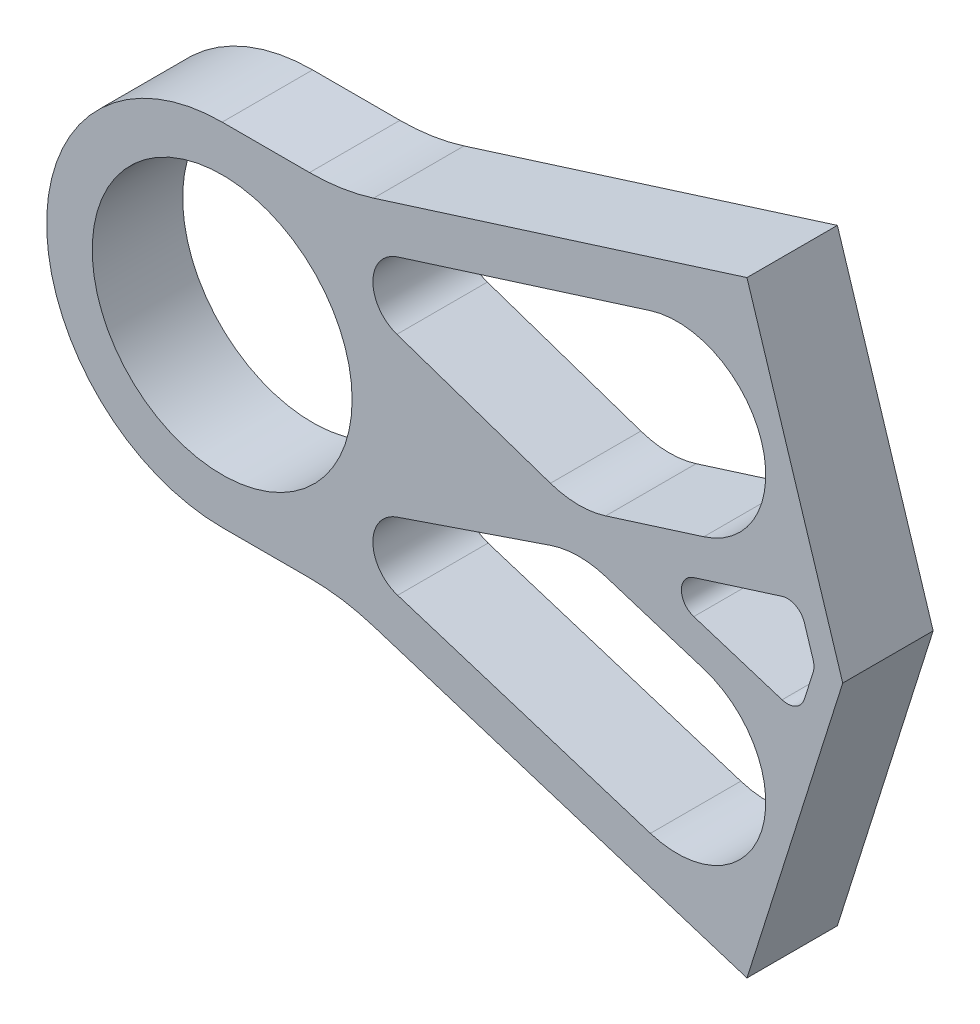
ISO-10303-21;
HEADER;
FILE_DESCRIPTION(('STEP AP214'),'2;1');
FILE_NAME('part.step','',(''),(''),'','','');
FILE_SCHEMA(('AUTOMOTIVE_DESIGN { 1 0 10303 214 1 1 1 1 }'));
ENDSEC;
DATA;
#1=APPLICATION_CONTEXT('core data for automotive mechanical design processes');
#2=APPLICATION_PROTOCOL_DEFINITION('international standard','automotive_design',2000,#1);
#3=PRODUCT_CONTEXT('',#1,'mechanical');
#4=PRODUCT('Part','Part','',(#3));
#5=PRODUCT_RELATED_PRODUCT_CATEGORY('part','',(#4));
#6=PRODUCT_DEFINITION_FORMATION('','',#4);
#7=PRODUCT_DEFINITION_CONTEXT('part definition',#1,'design');
#8=PRODUCT_DEFINITION('design','',#6,#7);
#9=PRODUCT_DEFINITION_SHAPE('','',#8);
#10=(LENGTH_UNIT() NAMED_UNIT(*) SI_UNIT(.MILLI.,.METRE.));
#11=(NAMED_UNIT(*) PLANE_ANGLE_UNIT() SI_UNIT($,.RADIAN.));
#12=(NAMED_UNIT(*) SI_UNIT($,.STERADIAN.) SOLID_ANGLE_UNIT());
#13=UNCERTAINTY_MEASURE_WITH_UNIT(LENGTH_MEASURE(1.E-05),#10,'distance_accuracy_value','');
#14=(GEOMETRIC_REPRESENTATION_CONTEXT(3) GLOBAL_UNCERTAINTY_ASSIGNED_CONTEXT((#13)) GLOBAL_UNIT_ASSIGNED_CONTEXT((#10,
#11,#12)) REPRESENTATION_CONTEXT('',''));
#15=CARTESIAN_POINT('',(0.,0.,0.));
#16=DIRECTION('',(0.,0.,1.));
#17=DIRECTION('',(1.,0.,0.));
#18=AXIS2_PLACEMENT_3D('',#15,#16,#17);
#19=CARTESIAN_POINT('',(0.,0.,3.2385));
#20=DIRECTION('',(0.,0.,1.));
#21=DIRECTION('',(1.,0.,0.));
#22=AXIS2_PLACEMENT_3D('',#19,#20,#21);
#23=PLANE('',#22);
#24=DIRECTION('',(0.953589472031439,0.301109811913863,0.));
#25=VECTOR('',#24,1.);
#26=CARTESIAN_POINT('',(23.6471212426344,13.9927931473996,3.2385));
#27=LINE('',#26,#25);
#28=CARTESIAN_POINT('',(12.5696109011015,10.4949073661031,3.2385));
#29=VERTEX_POINT('',#28);
#30=CARTESIAN_POINT('',(30.6741591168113,16.2116830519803,3.2385));
#31=VERTEX_POINT('',#30);
#32=EDGE_CURVE('E312',#29,#31,#27,.T.);
#33=ORIENTED_EDGE('',*,*,#32,.T.);
#34=CARTESIAN_POINT('',(32.5862064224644,10.1563899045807,3.2385));
#35=DIRECTION('',(0.,0.,-1.));
#36=DIRECTION('',(1.,0.,0.));
#37=AXIS2_PLACEMENT_3D('',#34,#35,#36);
#38=CIRCLE('',#37,6.35);
#39=CARTESIAN_POINT('',(34.4982537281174,4.10109675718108,3.2385));
#40=VERTEX_POINT('',#39);
#41=EDGE_CURVE('E245',#31,#40,#38,.T.);
#42=ORIENTED_EDGE('',*,*,#41,.T.);
#43=DIRECTION('',(-0.953589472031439,-0.301109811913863,0.));
#44=VECTOR('',#43,1.);
#45=CARTESIAN_POINT('',(27.4712158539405,1.88220685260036,3.2385));
#46=LINE('',#45,#44);
#47=CARTESIAN_POINT('',(27.4712158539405,1.88220685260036,3.2385));
#48=VERTEX_POINT('',#47);
#49=EDGE_CURVE('E300',#40,#48,#46,.T.);
#50=ORIENTED_EDGE('',*,*,#49,.T.);
#51=CARTESIAN_POINT('',(25.5591685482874,7.9375,3.2385));
#52=DIRECTION('',(0.,0.,-1.));
#53=DIRECTION('',(1.,0.,0.));
#54=AXIS2_PLACEMENT_3D('',#51,#52,#53);
#55=CIRCLE('',#54,6.35);
#56=CARTESIAN_POINT('',(23.5135791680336,1.92600566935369,3.2385));
#57=VERTEX_POINT('',#56);
#58=EDGE_CURVE('E303',#48,#57,#55,.T.);
#59=ORIENTED_EDGE('',*,*,#58,.T.);
#60=DIRECTION('',(-0.946692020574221,0.322140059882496,0.));
#61=VECTOR('',#60,1.);
#62=CARTESIAN_POINT('',(12.5161940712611,5.6681923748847,3.2385));
#63=LINE('',#62,#61);
#64=CARTESIAN_POINT('',(12.5161940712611,5.6681923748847,3.2385));
#65=VERTEX_POINT('',#64);
#66=EDGE_CURVE('E306',#57,#65,#63,.T.);
#67=ORIENTED_EDGE('',*,*,#66,.T.);
#68=CARTESIAN_POINT('',(13.3344298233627,8.07279010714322,3.2385));
#69=DIRECTION('',(0.,0.,-1.));
#70=DIRECTION('',(1.,0.,0.));
#71=AXIS2_PLACEMENT_3D('',#68,#69,#70);
#72=CIRCLE('',#71,2.54);
#73=EDGE_CURVE('E309',#65,#29,#72,.T.);
#74=ORIENTED_EDGE('',*,*,#73,.T.);
#75=EDGE_LOOP('',(#33,#42,#50,#59,#67,#74));
#76=FACE_BOUND('',#75,.T.);
#77=CARTESIAN_POINT('',(0.,0.,3.2385));
#78=DIRECTION('',(0.,0.,1.));
#79=DIRECTION('',(1.,0.,0.));
#80=AXIS2_PLACEMENT_3D('',#77,#78,#79);
#81=CIRCLE('',#80,12.573);
#82=CARTESIAN_POINT('',(0.,12.573,3.2385));
#83=VERTEX_POINT('',#82);
#84=CARTESIAN_POINT('',(0.,-12.573,3.2385));
#85=VERTEX_POINT('',#84);
#86=EDGE_CURVE('E408',#83,#85,#81,.T.);
#87=ORIENTED_EDGE('',*,*,#86,.T.);
#88=DIRECTION('',(1.,0.,0.));
#89=VECTOR('',#88,1.);
#90=CARTESIAN_POINT('',(0.,-12.573,3.2385));
#91=LINE('',#90,#89);
#92=CARTESIAN_POINT('',(6.25746458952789,-12.573,3.2385));
#93=VERTEX_POINT('',#92);
#94=EDGE_CURVE('E411',#85,#93,#91,.T.);
#95=ORIENTED_EDGE('',*,*,#94,.T.);
#96=CARTESIAN_POINT('',(6.25746458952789,-27.813,3.2385));
#97=DIRECTION('',(0.,0.,-1.));
#98=DIRECTION('',(1.,0.,0.));
#99=AXIS2_PLACEMENT_3D('',#96,#97,#98);
#100=CIRCLE('',#99,15.24);
#101=CARTESIAN_POINT('',(10.8463781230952,-13.2802964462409,3.2385));
#102=VERTEX_POINT('',#101);
#103=EDGE_CURVE('E413',#93,#102,#100,.T.);
#104=ORIENTED_EDGE('',*,*,#103,.T.);
#105=DIRECTION('',(0.953589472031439,-0.301109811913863,0.));
#106=VECTOR('',#105,1.);
#107=CARTESIAN_POINT('',(10.8463781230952,-13.2802964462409,3.2385));
#108=LINE('',#107,#106);
#109=CARTESIAN_POINT('',(37.5900165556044,-21.7249911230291,3.2385));
#110=VERTEX_POINT('',#109);
#111=EDGE_CURVE('E415',#102,#110,#108,.T.);
#112=ORIENTED_EDGE('',*,*,#111,.T.);
#113=DIRECTION('',(0.301109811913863,0.953589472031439,0.));
#114=VECTOR('',#113,1.);
#115=CARTESIAN_POINT('',(44.45,0.,3.2385));
#116=LINE('',#115,#114);
#117=CARTESIAN_POINT('',(44.45,0.,3.2385));
#118=VERTEX_POINT('',#117);
#119=EDGE_CURVE('E417',#110,#118,#116,.T.);
#120=ORIENTED_EDGE('',*,*,#119,.T.);
#121=DIRECTION('',(-0.301109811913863,0.953589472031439,0.));
#122=VECTOR('',#121,1.);
#123=CARTESIAN_POINT('',(37.5900165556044,21.7249911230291,3.2385));
#124=LINE('',#123,#122);
#125=CARTESIAN_POINT('',(37.5900165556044,21.7249911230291,3.2385));
#126=VERTEX_POINT('',#125);
#127=EDGE_CURVE('E419',#118,#126,#124,.T.);
#128=ORIENTED_EDGE('',*,*,#127,.T.);
#129=DIRECTION('',(-0.953589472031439,-0.301109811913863,0.));
#130=VECTOR('',#129,1.);
#131=CARTESIAN_POINT('',(10.8463781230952,13.2802964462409,3.2385));
#132=LINE('',#131,#130);
#133=CARTESIAN_POINT('',(10.8463781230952,13.2802964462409,3.2385));
#134=VERTEX_POINT('',#133);
#135=EDGE_CURVE('E421',#126,#134,#132,.T.);
#136=ORIENTED_EDGE('',*,*,#135,.T.);
#137=CARTESIAN_POINT('',(6.25746458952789,27.813,3.2385));
#138=DIRECTION('',(0.,0.,-1.));
#139=DIRECTION('',(-1.,0.,0.));
#140=AXIS2_PLACEMENT_3D('',#137,#138,#139);
#141=CIRCLE('',#140,15.24);
#142=CARTESIAN_POINT('',(6.25746458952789,12.573,3.2385));
#143=VERTEX_POINT('',#142);
#144=EDGE_CURVE('E423',#134,#143,#141,.T.);
#145=ORIENTED_EDGE('',*,*,#144,.T.);
#146=DIRECTION('',(-1.,0.,0.));
#147=VECTOR('',#146,1.);
#148=CARTESIAN_POINT('',(0.,12.573,3.2385));
#149=LINE('',#148,#147);
#150=EDGE_CURVE('E425',#143,#83,#149,.T.);
#151=ORIENTED_EDGE('',*,*,#150,.T.);
#152=EDGE_LOOP('',(#87,#95,#104,#112,#120,#128,#136,#145,#151));
#153=FACE_BOUND('',#152,.T.);
#154=DIRECTION('',(0.946692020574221,0.322140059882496,0.));
#155=VECTOR('',#154,1.);
#156=CARTESIAN_POINT('',(12.5161940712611,-5.6681923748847,3.2385));
#157=LINE('',#156,#155);
#158=CARTESIAN_POINT('',(12.5161940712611,-5.6681923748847,3.2385));
#159=VERTEX_POINT('',#158);
#160=CARTESIAN_POINT('',(23.5135791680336,-1.9260056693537,3.2385));
#161=VERTEX_POINT('',#160);
#162=EDGE_CURVE('E358',#159,#161,#157,.T.);
#163=ORIENTED_EDGE('',*,*,#162,.T.);
#164=CARTESIAN_POINT('',(25.5591685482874,-7.9375,3.2385));
#165=DIRECTION('',(0.,0.,-1.));
#166=DIRECTION('',(-1.,0.,0.));
#167=AXIS2_PLACEMENT_3D('',#164,#165,#166);
#168=CIRCLE('',#167,6.35);
#169=CARTESIAN_POINT('',(27.4712158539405,-1.88220685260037,3.2385));
#170=VERTEX_POINT('',#169);
#171=EDGE_CURVE('E343',#161,#170,#168,.T.);
#172=ORIENTED_EDGE('',*,*,#171,.T.);
#173=DIRECTION('',(0.953589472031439,-0.301109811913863,0.));
#174=VECTOR('',#173,1.);
#175=CARTESIAN_POINT('',(27.4712158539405,-1.88220685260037,3.2385));
#176=LINE('',#175,#174);
#177=CARTESIAN_POINT('',(34.4982537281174,-4.10109675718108,3.2385));
#178=VERTEX_POINT('',#177);
#179=EDGE_CURVE('E346',#170,#178,#176,.T.);
#180=ORIENTED_EDGE('',*,*,#179,.T.);
#181=CARTESIAN_POINT('',(32.5862064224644,-10.1563899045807,3.2385));
#182=DIRECTION('',(0.,0.,-1.));
#183=DIRECTION('',(-1.,0.,0.));
#184=AXIS2_PLACEMENT_3D('',#181,#182,#183);
#185=CIRCLE('',#184,6.35);
#186=CARTESIAN_POINT('',(30.6741591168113,-16.2116830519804,3.2385));
#187=VERTEX_POINT('',#186);
#188=EDGE_CURVE('E349',#178,#187,#185,.T.);
#189=ORIENTED_EDGE('',*,*,#188,.T.);
#190=DIRECTION('',(-0.953589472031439,0.301109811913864,0.));
#191=VECTOR('',#190,1.);
#192=CARTESIAN_POINT('',(12.5696109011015,-10.4949073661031,3.2385));
#193=LINE('',#192,#191);
#194=CARTESIAN_POINT('',(12.5696109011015,-10.4949073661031,3.2385));
#195=VERTEX_POINT('',#194);
#196=EDGE_CURVE('E352',#187,#195,#193,.T.);
#197=ORIENTED_EDGE('',*,*,#196,.T.);
#198=CARTESIAN_POINT('',(13.3344298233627,-8.07279010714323,3.2385));
#199=DIRECTION('',(0.,0.,-1.));
#200=DIRECTION('',(1.,0.,0.));
#201=AXIS2_PLACEMENT_3D('',#198,#199,#200);
#202=CIRCLE('',#201,2.54);
#203=EDGE_CURVE('E355',#195,#159,#202,.T.);
#204=ORIENTED_EDGE('',*,*,#203,.T.);
#205=EDGE_LOOP('',(#163,#172,#180,#189,#197,#204));
#206=FACE_BOUND('',#205,.T.);
#207=DIRECTION('',(-0.953589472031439,0.301109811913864,0.));
#208=VECTOR('',#207,1.);
#209=CARTESIAN_POINT('',(33.7812065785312,-1.21105862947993,3.2385));
#210=LINE('',#209,#208);
#211=CARTESIAN_POINT('',(40.1073071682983,-3.20861734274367,3.2385));
#212=VERTEX_POINT('',#211);
#213=CARTESIAN_POINT('',(33.7812065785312,-1.21105862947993,3.2385));
#214=VERTEX_POINT('',#213);
#215=EDGE_CURVE('E250',#212,#214,#210,.T.);
#216=ORIENTED_EDGE('',*,*,#215,.T.);
#217=CARTESIAN_POINT('',(34.1636160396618,0.,3.2385));
#218=DIRECTION('',(0.,0.,-1.));
#219=DIRECTION('',(1.,0.,0.));
#220=AXIS2_PLACEMENT_3D('',#217,#218,#219);
#221=CIRCLE('',#220,1.27);
#222=CARTESIAN_POINT('',(33.7812065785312,1.21105862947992,3.2385));
#223=VERTEX_POINT('',#222);
#224=EDGE_CURVE('E53',#214,#223,#221,.T.);
#225=ORIENTED_EDGE('',*,*,#224,.T.);
#226=DIRECTION('',(0.953589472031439,0.301109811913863,0.));
#227=VECTOR('',#226,1.);
#228=CARTESIAN_POINT('',(40.1073071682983,3.20861734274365,3.2385));
#229=LINE('',#228,#227);
#230=CARTESIAN_POINT('',(40.1073071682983,3.20861734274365,3.2385));
#231=VERTEX_POINT('',#230);
#232=EDGE_CURVE('E231',#223,#231,#229,.T.);
#233=ORIENTED_EDGE('',*,*,#232,.T.);
#234=CARTESIAN_POINT('',(40.4897166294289,1.99755871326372,3.2385));
#235=DIRECTION('',(0.,0.,-1.));
#236=DIRECTION('',(-1.,0.,0.));
#237=AXIS2_PLACEMENT_3D('',#234,#235,#236);
#238=CIRCLE('',#237,1.27);
#239=CARTESIAN_POINT('',(41.7007752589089,2.37996817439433,3.2385));
#240=VERTEX_POINT('',#239);
#241=EDGE_CURVE('E240',#231,#240,#238,.T.);
#242=ORIENTED_EDGE('',*,*,#241,.T.);
#243=DIRECTION('',(0.301109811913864,-0.953589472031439,0.));
#244=VECTOR('',#243,1.);
#245=CARTESIAN_POINT('',(42.3315336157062,0.382409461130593,3.2385));
#246=LINE('',#245,#244);
#247=CARTESIAN_POINT('',(42.3315336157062,0.382409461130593,3.2385));
#248=VERTEX_POINT('',#247);
#249=EDGE_CURVE('E259',#240,#248,#246,.T.);
#250=ORIENTED_EDGE('',*,*,#249,.T.);
#251=CARTESIAN_POINT('',(41.1204749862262,0.,3.2385));
#252=DIRECTION('',(0.,0.,-1.));
#253=DIRECTION('',(1.,0.,0.));
#254=AXIS2_PLACEMENT_3D('',#251,#252,#253);
#255=CIRCLE('',#254,1.27000000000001);
#256=CARTESIAN_POINT('',(42.3315336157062,-0.382409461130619,3.2385));
#257=VERTEX_POINT('',#256);
#258=EDGE_CURVE('E262',#248,#257,#255,.T.);
#259=ORIENTED_EDGE('',*,*,#258,.T.);
#260=DIRECTION('',(-0.301109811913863,-0.953589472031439,0.));
#261=VECTOR('',#260,1.);
#262=CARTESIAN_POINT('',(41.7007752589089,-2.37996817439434,3.2385));
#263=LINE('',#262,#261);
#264=CARTESIAN_POINT('',(41.7007752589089,-2.37996817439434,3.2385));
#265=VERTEX_POINT('',#264);
#266=EDGE_CURVE('E265',#257,#265,#263,.T.);
#267=ORIENTED_EDGE('',*,*,#266,.T.);
#268=CARTESIAN_POINT('',(40.4897166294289,-1.99755871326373,3.2385));
#269=DIRECTION('',(0.,0.,-1.));
#270=DIRECTION('',(-1.,0.,0.));
#271=AXIS2_PLACEMENT_3D('',#268,#269,#270);
#272=CIRCLE('',#271,1.27000000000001);
#273=EDGE_CURVE('E268',#265,#212,#272,.T.);
#274=ORIENTED_EDGE('',*,*,#273,.T.);
#275=EDGE_LOOP('',(#216,#225,#233,#242,#250,#259,#267,#274));
#276=FACE_BOUND('',#275,.T.);
#277=CARTESIAN_POINT('',(0.,0.,3.2385));
#278=DIRECTION('',(0.,0.,1.));
#279=DIRECTION('',(1.,0.,0.));
#280=AXIS2_PLACEMENT_3D('',#277,#278,#279);
#281=CIRCLE('',#280,9.3091);
#282=CARTESIAN_POINT('',(9.3091,0.,3.2385));
#283=VERTEX_POINT('',#282);
#284=EDGE_CURVE('E254',#283,#283,#281,.T.);
#285=ORIENTED_EDGE('',*,*,#284,.F.);
#286=EDGE_LOOP('',(#285));
#287=FACE_BOUND('',#286,.T.);
#288=ADVANCED_FACE('F38',(#76,#153,#206,#276,#287),#23,.T.);
#289=CARTESIAN_POINT('',(0.,0.,-3.2385));
#290=DIRECTION('',(0.,0.,1.));
#291=DIRECTION('',(1.,0.,0.));
#292=AXIS2_PLACEMENT_3D('',#289,#290,#291);
#293=PLANE('',#292);
#294=CARTESIAN_POINT('',(32.5862064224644,10.1563899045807,-3.2385));
#295=DIRECTION('',(0.,0.,-1.));
#296=DIRECTION('',(1.,0.,0.));
#297=AXIS2_PLACEMENT_3D('',#294,#295,#296);
#298=CIRCLE('',#297,6.35);
#299=CARTESIAN_POINT('',(30.6741591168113,16.2116830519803,-3.2385));
#300=VERTEX_POINT('',#299);
#301=CARTESIAN_POINT('',(34.4982537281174,4.10109675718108,-3.2385));
#302=VERTEX_POINT('',#301);
#303=EDGE_CURVE('E315',#300,#302,#298,.T.);
#304=ORIENTED_EDGE('',*,*,#303,.F.);
#305=DIRECTION('',(0.953589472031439,0.301109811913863,0.));
#306=VECTOR('',#305,1.);
#307=CARTESIAN_POINT('',(23.6471212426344,13.9927931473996,-3.2385));
#308=LINE('',#307,#306);
#309=CARTESIAN_POINT('',(12.5696109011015,10.4949073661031,-3.2385));
#310=VERTEX_POINT('',#309);
#311=EDGE_CURVE('E326',#310,#300,#308,.T.);
#312=ORIENTED_EDGE('',*,*,#311,.F.);
#313=CARTESIAN_POINT('',(13.3344298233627,8.07279010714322,-3.2385));
#314=DIRECTION('',(0.,0.,-1.));
#315=DIRECTION('',(1.,0.,0.));
#316=AXIS2_PLACEMENT_3D('',#313,#314,#315);
#317=CIRCLE('',#316,2.54);
#318=CARTESIAN_POINT('',(12.5161940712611,5.6681923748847,-3.2385));
#319=VERTEX_POINT('',#318);
#320=EDGE_CURVE('E323',#319,#310,#317,.T.);
#321=ORIENTED_EDGE('',*,*,#320,.F.);
#322=DIRECTION('',(-0.946692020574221,0.322140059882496,0.));
#323=VECTOR('',#322,1.);
#324=CARTESIAN_POINT('',(12.5161940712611,5.6681923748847,-3.2385));
#325=LINE('',#324,#323);
#326=CARTESIAN_POINT('',(23.5135791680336,1.92600566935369,-3.2385));
#327=VERTEX_POINT('',#326);
#328=EDGE_CURVE('E321',#327,#319,#325,.T.);
#329=ORIENTED_EDGE('',*,*,#328,.F.);
#330=CARTESIAN_POINT('',(25.5591685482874,7.9375,-3.2385));
#331=DIRECTION('',(0.,0.,-1.));
#332=DIRECTION('',(1.,0.,0.));
#333=AXIS2_PLACEMENT_3D('',#330,#331,#332);
#334=CIRCLE('',#333,6.35);
#335=CARTESIAN_POINT('',(27.4712158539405,1.88220685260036,-3.2385));
#336=VERTEX_POINT('',#335);
#337=EDGE_CURVE('E319',#336,#327,#334,.T.);
#338=ORIENTED_EDGE('',*,*,#337,.F.);
#339=DIRECTION('',(-0.953589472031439,-0.301109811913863,0.));
#340=VECTOR('',#339,1.);
#341=CARTESIAN_POINT('',(27.4712158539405,1.88220685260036,-3.2385));
#342=LINE('',#341,#340);
#343=EDGE_CURVE('E317',#302,#336,#342,.T.);
#344=ORIENTED_EDGE('',*,*,#343,.F.);
#345=EDGE_LOOP('',(#304,#312,#321,#329,#338,#344));
#346=FACE_BOUND('',#345,.T.);
#347=CARTESIAN_POINT('',(0.,0.,-3.2385));
#348=DIRECTION('',(0.,0.,1.));
#349=DIRECTION('',(1.,0.,0.));
#350=AXIS2_PLACEMENT_3D('',#347,#348,#349);
#351=CIRCLE('',#350,12.573);
#352=CARTESIAN_POINT('',(0.,12.573,-3.2385));
#353=VERTEX_POINT('',#352);
#354=CARTESIAN_POINT('',(0.,-12.573,-3.2385));
#355=VERTEX_POINT('',#354);
#356=EDGE_CURVE('E389',#353,#355,#351,.T.);
#357=ORIENTED_EDGE('',*,*,#356,.F.);
#358=DIRECTION('',(-1.,0.,0.));
#359=VECTOR('',#358,1.);
#360=CARTESIAN_POINT('',(0.,12.573,-3.2385));
#361=LINE('',#360,#359);
#362=CARTESIAN_POINT('',(6.25746458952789,12.573,-3.2385));
#363=VERTEX_POINT('',#362);
#364=EDGE_CURVE('E406',#363,#353,#361,.T.);
#365=ORIENTED_EDGE('',*,*,#364,.F.);
#366=CARTESIAN_POINT('',(6.25746458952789,27.813,-3.2385));
#367=DIRECTION('',(0.,0.,-1.));
#368=DIRECTION('',(-1.,0.,0.));
#369=AXIS2_PLACEMENT_3D('',#366,#367,#368);
#370=CIRCLE('',#369,15.24);
#371=CARTESIAN_POINT('',(10.8463781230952,13.2802964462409,-3.2385));
#372=VERTEX_POINT('',#371);
#373=EDGE_CURVE('E404',#372,#363,#370,.T.);
#374=ORIENTED_EDGE('',*,*,#373,.F.);
#375=DIRECTION('',(-0.953589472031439,-0.301109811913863,0.));
#376=VECTOR('',#375,1.);
#377=CARTESIAN_POINT('',(10.8463781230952,13.2802964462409,-3.2385));
#378=LINE('',#377,#376);
#379=CARTESIAN_POINT('',(37.5900165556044,21.7249911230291,-3.2385));
#380=VERTEX_POINT('',#379);
#381=EDGE_CURVE('E402',#380,#372,#378,.T.);
#382=ORIENTED_EDGE('',*,*,#381,.F.);
#383=DIRECTION('',(-0.301109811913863,0.953589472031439,0.));
#384=VECTOR('',#383,1.);
#385=CARTESIAN_POINT('',(37.5900165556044,21.7249911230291,-3.2385));
#386=LINE('',#385,#384);
#387=CARTESIAN_POINT('',(44.45,0.,-3.2385));
#388=VERTEX_POINT('',#387);
#389=EDGE_CURVE('E400',#388,#380,#386,.T.);
#390=ORIENTED_EDGE('',*,*,#389,.F.);
#391=DIRECTION('',(0.301109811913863,0.953589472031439,0.));
#392=VECTOR('',#391,1.);
#393=CARTESIAN_POINT('',(44.45,0.,-3.2385));
#394=LINE('',#393,#392);
#395=CARTESIAN_POINT('',(37.5900165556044,-21.7249911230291,-3.2385));
#396=VERTEX_POINT('',#395);
#397=EDGE_CURVE('E398',#396,#388,#394,.T.);
#398=ORIENTED_EDGE('',*,*,#397,.F.);
#399=DIRECTION('',(0.953589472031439,-0.301109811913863,0.));
#400=VECTOR('',#399,1.);
#401=CARTESIAN_POINT('',(10.8463781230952,-13.2802964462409,-3.2385));
#402=LINE('',#401,#400);
#403=CARTESIAN_POINT('',(10.8463781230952,-13.2802964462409,-3.2385));
#404=VERTEX_POINT('',#403);
#405=EDGE_CURVE('E396',#404,#396,#402,.T.);
#406=ORIENTED_EDGE('',*,*,#405,.F.);
#407=CARTESIAN_POINT('',(6.25746458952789,-27.813,-3.2385));
#408=DIRECTION('',(0.,0.,-1.));
#409=DIRECTION('',(1.,0.,0.));
#410=AXIS2_PLACEMENT_3D('',#407,#408,#409);
#411=CIRCLE('',#410,15.24);
#412=CARTESIAN_POINT('',(6.25746458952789,-12.573,-3.2385));
#413=VERTEX_POINT('',#412);
#414=EDGE_CURVE('E394',#413,#404,#411,.T.);
#415=ORIENTED_EDGE('',*,*,#414,.F.);
#416=DIRECTION('',(1.,0.,0.));
#417=VECTOR('',#416,1.);
#418=CARTESIAN_POINT('',(0.,-12.573,-3.2385));
#419=LINE('',#418,#417);
#420=EDGE_CURVE('E392',#355,#413,#419,.T.);
#421=ORIENTED_EDGE('',*,*,#420,.F.);
#422=EDGE_LOOP('',(#357,#365,#374,#382,#390,#398,#406,#415,#421));
#423=FACE_BOUND('',#422,.T.);
#424=CARTESIAN_POINT('',(25.5591685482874,-7.9375,-3.2385));
#425=DIRECTION('',(0.,0.,-1.));
#426=DIRECTION('',(-1.,0.,0.));
#427=AXIS2_PLACEMENT_3D('',#424,#425,#426);
#428=CIRCLE('',#427,6.35);
#429=CARTESIAN_POINT('',(23.5135791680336,-1.9260056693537,-3.2385));
#430=VERTEX_POINT('',#429);
#431=CARTESIAN_POINT('',(27.4712158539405,-1.88220685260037,-3.2385));
#432=VERTEX_POINT('',#431);
#433=EDGE_CURVE('E361',#430,#432,#428,.T.);
#434=ORIENTED_EDGE('',*,*,#433,.F.);
#435=DIRECTION('',(0.946692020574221,0.322140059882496,0.));
#436=VECTOR('',#435,1.);
#437=CARTESIAN_POINT('',(12.5161940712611,-5.6681923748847,-3.2385));
#438=LINE('',#437,#436);
#439=CARTESIAN_POINT('',(12.5161940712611,-5.6681923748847,-3.2385));
#440=VERTEX_POINT('',#439);
#441=EDGE_CURVE('E372',#440,#430,#438,.T.);
#442=ORIENTED_EDGE('',*,*,#441,.F.);
#443=CARTESIAN_POINT('',(13.3344298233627,-8.07279010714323,-3.2385));
#444=DIRECTION('',(0.,0.,-1.));
#445=DIRECTION('',(1.,0.,0.));
#446=AXIS2_PLACEMENT_3D('',#443,#444,#445);
#447=CIRCLE('',#446,2.54);
#448=CARTESIAN_POINT('',(12.5696109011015,-10.4949073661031,-3.2385));
#449=VERTEX_POINT('',#448);
#450=EDGE_CURVE('E369',#449,#440,#447,.T.);
#451=ORIENTED_EDGE('',*,*,#450,.F.);
#452=DIRECTION('',(-0.953589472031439,0.301109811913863,0.));
#453=VECTOR('',#452,1.);
#454=CARTESIAN_POINT('',(23.6471212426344,-13.9927931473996,-3.2385));
#455=LINE('',#454,#453);
#456=CARTESIAN_POINT('',(30.6741591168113,-16.2116830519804,-3.2385));
#457=VERTEX_POINT('',#456);
#458=EDGE_CURVE('E367',#457,#449,#455,.T.);
#459=ORIENTED_EDGE('',*,*,#458,.F.);
#460=CARTESIAN_POINT('',(32.5862064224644,-10.1563899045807,-3.2385));
#461=DIRECTION('',(0.,0.,-1.));
#462=DIRECTION('',(-1.,0.,0.));
#463=AXIS2_PLACEMENT_3D('',#460,#461,#462);
#464=CIRCLE('',#463,6.35);
#465=CARTESIAN_POINT('',(34.4982537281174,-4.10109675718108,-3.2385));
#466=VERTEX_POINT('',#465);
#467=EDGE_CURVE('E365',#466,#457,#464,.T.);
#468=ORIENTED_EDGE('',*,*,#467,.F.);
#469=DIRECTION('',(0.953589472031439,-0.301109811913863,0.));
#470=VECTOR('',#469,1.);
#471=CARTESIAN_POINT('',(27.4712158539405,-1.88220685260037,-3.2385));
#472=LINE('',#471,#470);
#473=EDGE_CURVE('E363',#432,#466,#472,.T.);
#474=ORIENTED_EDGE('',*,*,#473,.F.);
#475=EDGE_LOOP('',(#434,#442,#451,#459,#468,#474));
#476=FACE_BOUND('',#475,.T.);
#477=CARTESIAN_POINT('',(34.1636160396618,0.,-3.2385));
#478=DIRECTION('',(0.,0.,-1.));
#479=DIRECTION('',(1.,0.,0.));
#480=AXIS2_PLACEMENT_3D('',#477,#478,#479);
#481=CIRCLE('',#480,1.27);
#482=CARTESIAN_POINT('',(33.7812065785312,-1.21105862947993,-3.2385));
#483=VERTEX_POINT('',#482);
#484=CARTESIAN_POINT('',(33.7812065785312,1.21105862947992,-3.2385));
#485=VERTEX_POINT('',#484);
#486=EDGE_CURVE('E244',#483,#485,#481,.T.);
#487=ORIENTED_EDGE('',*,*,#486,.F.);
#488=DIRECTION('',(-0.953589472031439,0.301109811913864,0.));
#489=VECTOR('',#488,1.);
#490=CARTESIAN_POINT('',(33.7812065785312,-1.21105862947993,-3.2385));
#491=LINE('',#490,#489);
#492=CARTESIAN_POINT('',(40.1073071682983,-3.20861734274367,-3.2385));
#493=VERTEX_POINT('',#492);
#494=EDGE_CURVE('E284',#493,#483,#491,.T.);
#495=ORIENTED_EDGE('',*,*,#494,.F.);
#496=CARTESIAN_POINT('',(40.4897166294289,-1.99755871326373,-3.2385));
#497=DIRECTION('',(0.,0.,-1.));
#498=DIRECTION('',(-1.,0.,0.));
#499=AXIS2_PLACEMENT_3D('',#496,#497,#498);
#500=CIRCLE('',#499,1.27000000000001);
#501=CARTESIAN_POINT('',(41.7007752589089,-2.37996817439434,-3.2385));
#502=VERTEX_POINT('',#501);
#503=EDGE_CURVE('E282',#502,#493,#500,.T.);
#504=ORIENTED_EDGE('',*,*,#503,.F.);
#505=DIRECTION('',(-0.301109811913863,-0.953589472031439,0.));
#506=VECTOR('',#505,1.);
#507=CARTESIAN_POINT('',(41.7007752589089,-2.37996817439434,-3.2385));
#508=LINE('',#507,#506);
#509=CARTESIAN_POINT('',(42.3315336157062,-0.382409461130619,-3.2385));
#510=VERTEX_POINT('',#509);
#511=EDGE_CURVE('E280',#510,#502,#508,.T.);
#512=ORIENTED_EDGE('',*,*,#511,.F.);
#513=CARTESIAN_POINT('',(41.1204749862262,0.,-3.2385));
#514=DIRECTION('',(0.,0.,-1.));
#515=DIRECTION('',(1.,0.,0.));
#516=AXIS2_PLACEMENT_3D('',#513,#514,#515);
#517=CIRCLE('',#516,1.27000000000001);
#518=CARTESIAN_POINT('',(42.3315336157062,0.382409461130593,-3.2385));
#519=VERTEX_POINT('',#518);
#520=EDGE_CURVE('E278',#519,#510,#517,.T.);
#521=ORIENTED_EDGE('',*,*,#520,.F.);
#522=DIRECTION('',(0.301109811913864,-0.953589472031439,0.));
#523=VECTOR('',#522,1.);
#524=CARTESIAN_POINT('',(42.3315336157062,0.382409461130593,-3.2385));
#525=LINE('',#524,#523);
#526=CARTESIAN_POINT('',(41.7007752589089,2.37996817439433,-3.2385));
#527=VERTEX_POINT('',#526);
#528=EDGE_CURVE('E276',#527,#519,#525,.T.);
#529=ORIENTED_EDGE('',*,*,#528,.F.);
#530=CARTESIAN_POINT('',(40.4897166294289,1.99755871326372,-3.2385));
#531=DIRECTION('',(0.,0.,-1.));
#532=DIRECTION('',(-1.,0.,0.));
#533=AXIS2_PLACEMENT_3D('',#530,#531,#532);
#534=CIRCLE('',#533,1.27);
#535=CARTESIAN_POINT('',(40.1073071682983,3.20861734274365,-3.2385));
#536=VERTEX_POINT('',#535);
#537=EDGE_CURVE('E274',#536,#527,#534,.T.);
#538=ORIENTED_EDGE('',*,*,#537,.F.);
#539=DIRECTION('',(0.953589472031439,0.301109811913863,0.));
#540=VECTOR('',#539,1.);
#541=CARTESIAN_POINT('',(40.1073071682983,3.20861734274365,-3.2385));
#542=LINE('',#541,#540);
#543=EDGE_CURVE('E272',#485,#536,#542,.T.);
#544=ORIENTED_EDGE('',*,*,#543,.F.);
#545=EDGE_LOOP('',(#487,#495,#504,#512,#521,#529,#538,#544));
#546=FACE_BOUND('',#545,.T.);
#547=CARTESIAN_POINT('',(0.,0.,-3.2385));
#548=DIRECTION('',(0.,0.,1.));
#549=DIRECTION('',(1.,0.,0.));
#550=AXIS2_PLACEMENT_3D('',#547,#548,#549);
#551=CIRCLE('',#550,9.3091);
#552=CARTESIAN_POINT('',(9.3091,0.,-3.2385));
#553=VERTEX_POINT('',#552);
#554=EDGE_CURVE('E251',#553,#553,#551,.F.);
#555=ORIENTED_EDGE('',*,*,#554,.F.);
#556=EDGE_LOOP('',(#555));
#557=FACE_BOUND('',#556,.T.);
#558=ADVANCED_FACE('F458',(#346,#423,#476,#546,#557),#293,.F.);
#559=CARTESIAN_POINT('',(0.,0.,3.2385));
#560=DIRECTION('',(0.,0.,-1.));
#561=DIRECTION('',(-1.,0.,0.));
#562=AXIS2_PLACEMENT_3D('',#559,#560,#561);
#563=CYLINDRICAL_SURFACE('',#562,12.573);
#564=ORIENTED_EDGE('',*,*,#356,.T.);
#565=DIRECTION('',(0.,0.,-1.));
#566=VECTOR('',#565,1.);
#567=CARTESIAN_POINT('',(0.,-12.573,3.2385));
#568=LINE('',#567,#566);
#569=EDGE_CURVE('E11',#85,#355,#568,.T.);
#570=ORIENTED_EDGE('',*,*,#569,.F.);
#571=ORIENTED_EDGE('',*,*,#86,.F.);
#572=DIRECTION('',(0.,0.,-1.));
#573=VECTOR('',#572,1.);
#574=CARTESIAN_POINT('',(0.,12.573,3.2385));
#575=LINE('',#574,#573);
#576=EDGE_CURVE('E427',#83,#353,#575,.T.);
#577=ORIENTED_EDGE('',*,*,#576,.T.);
#578=EDGE_LOOP('',(#564,#570,#571,#577));
#579=FACE_BOUND('',#578,.T.);
#580=ADVANCED_FACE('F40',(#579),#563,.T.);
#581=CARTESIAN_POINT('',(0.,-12.573,3.2385));
#582=DIRECTION('',(0.,1.,0.));
#583=DIRECTION('',(0.,0.,1.));
#584=AXIS2_PLACEMENT_3D('',#581,#582,#583);
#585=PLANE('',#584);
#586=ORIENTED_EDGE('',*,*,#420,.T.);
#587=DIRECTION('',(0.,0.,-1.));
#588=VECTOR('',#587,1.);
#589=CARTESIAN_POINT('',(6.25746458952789,-12.573,3.2385));
#590=LINE('',#589,#588);
#591=EDGE_CURVE('E46',#93,#413,#590,.T.);
#592=ORIENTED_EDGE('',*,*,#591,.F.);
#593=ORIENTED_EDGE('',*,*,#94,.F.);
#594=ORIENTED_EDGE('',*,*,#569,.T.);
#595=EDGE_LOOP('',(#586,#592,#593,#594));
#596=FACE_BOUND('',#595,.T.);
#597=ADVANCED_FACE('F476',(#596),#585,.F.);
#598=CARTESIAN_POINT('',(6.25746458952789,-27.813,3.2385));
#599=DIRECTION('',(0.,0.,-1.));
#600=DIRECTION('',(-1.,0.,0.));
#601=AXIS2_PLACEMENT_3D('',#598,#599,#600);
#602=CYLINDRICAL_SURFACE('',#601,15.24);
#603=ORIENTED_EDGE('',*,*,#414,.T.);
#604=DIRECTION('',(0.,0.,-1.));
#605=VECTOR('',#604,1.);
#606=CARTESIAN_POINT('',(10.8463781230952,-13.2802964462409,3.2385));
#607=LINE('',#606,#605);
#608=EDGE_CURVE('E445',#102,#404,#607,.T.);
#609=ORIENTED_EDGE('',*,*,#608,.F.);
#610=ORIENTED_EDGE('',*,*,#103,.F.);
#611=ORIENTED_EDGE('',*,*,#591,.T.);
#612=EDGE_LOOP('',(#603,#609,#610,#611));
#613=FACE_BOUND('',#612,.T.);
#614=ADVANCED_FACE('F452',(#613),#602,.F.);
#615=CARTESIAN_POINT('',(10.8463781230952,-13.2802964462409,3.2385));
#616=DIRECTION('',(0.301109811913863,0.953589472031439,0.));
#617=DIRECTION('',(-0.953589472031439,0.301109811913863,0.));
#618=AXIS2_PLACEMENT_3D('',#615,#616,#617);
#619=PLANE('',#618);
#620=ORIENTED_EDGE('',*,*,#405,.T.);
#621=DIRECTION('',(0.,0.,-1.));
#622=VECTOR('',#621,1.);
#623=CARTESIAN_POINT('',(37.5900165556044,-21.7249911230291,3.2385));
#624=LINE('',#623,#622);
#625=EDGE_CURVE('E442',#110,#396,#624,.T.);
#626=ORIENTED_EDGE('',*,*,#625,.F.);
#627=ORIENTED_EDGE('',*,*,#111,.F.);
#628=ORIENTED_EDGE('',*,*,#608,.T.);
#629=EDGE_LOOP('',(#620,#626,#627,#628));
#630=FACE_BOUND('',#629,.T.);
#631=ADVANCED_FACE('F464',(#630),#619,.F.);
#632=CARTESIAN_POINT('',(44.45,0.,3.2385));
#633=DIRECTION('',(-0.953589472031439,0.301109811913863,0.));
#634=DIRECTION('',(-0.301109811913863,-0.953589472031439,0.));
#635=AXIS2_PLACEMENT_3D('',#632,#633,#634);
#636=PLANE('',#635);
#637=ORIENTED_EDGE('',*,*,#397,.T.);
#638=DIRECTION('',(0.,0.,-1.));
#639=VECTOR('',#638,1.);
#640=CARTESIAN_POINT('',(44.45,0.,3.2385));
#641=LINE('',#640,#639);
#642=EDGE_CURVE('E439',#118,#388,#641,.T.);
#643=ORIENTED_EDGE('',*,*,#642,.F.);
#644=ORIENTED_EDGE('',*,*,#119,.F.);
#645=ORIENTED_EDGE('',*,*,#625,.T.);
#646=EDGE_LOOP('',(#637,#643,#644,#645));
#647=FACE_BOUND('',#646,.T.);
#648=ADVANCED_FACE('F468',(#647),#636,.F.);
#649=CARTESIAN_POINT('',(37.5900165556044,21.7249911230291,3.2385));
#650=DIRECTION('',(-0.953589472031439,-0.301109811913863,0.));
#651=DIRECTION('',(0.301109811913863,-0.953589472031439,0.));
#652=AXIS2_PLACEMENT_3D('',#649,#650,#651);
#653=PLANE('',#652);
#654=ORIENTED_EDGE('',*,*,#389,.T.);
#655=DIRECTION('',(0.,0.,-1.));
#656=VECTOR('',#655,1.);
#657=CARTESIAN_POINT('',(37.5900165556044,21.7249911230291,3.2385));
#658=LINE('',#657,#656);
#659=EDGE_CURVE('E436',#126,#380,#658,.T.);
#660=ORIENTED_EDGE('',*,*,#659,.F.);
#661=ORIENTED_EDGE('',*,*,#127,.F.);
#662=ORIENTED_EDGE('',*,*,#642,.T.);
#663=EDGE_LOOP('',(#654,#660,#661,#662));
#664=FACE_BOUND('',#663,.T.);
#665=ADVANCED_FACE('F494',(#664),#653,.F.);
#666=CARTESIAN_POINT('',(10.8463781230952,13.2802964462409,3.2385));
#667=DIRECTION('',(0.301109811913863,-0.953589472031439,0.));
#668=DIRECTION('',(0.953589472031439,0.301109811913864,0.));
#669=AXIS2_PLACEMENT_3D('',#666,#667,#668);
#670=PLANE('',#669);
#671=ORIENTED_EDGE('',*,*,#381,.T.);
#672=DIRECTION('',(0.,0.,-1.));
#673=VECTOR('',#672,1.);
#674=CARTESIAN_POINT('',(10.8463781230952,13.2802964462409,3.2385));
#675=LINE('',#674,#673);
#676=EDGE_CURVE('E433',#134,#372,#675,.T.);
#677=ORIENTED_EDGE('',*,*,#676,.F.);
#678=ORIENTED_EDGE('',*,*,#135,.F.);
#679=ORIENTED_EDGE('',*,*,#659,.T.);
#680=EDGE_LOOP('',(#671,#677,#678,#679));
#681=FACE_BOUND('',#680,.T.);
#682=ADVANCED_FACE('F492',(#681),#670,.F.);
#683=CARTESIAN_POINT('',(6.25746458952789,27.813,3.2385));
#684=DIRECTION('',(0.,0.,-1.));
#685=DIRECTION('',(-1.,0.,0.));
#686=AXIS2_PLACEMENT_3D('',#683,#684,#685);
#687=CYLINDRICAL_SURFACE('',#686,15.24);
#688=ORIENTED_EDGE('',*,*,#373,.T.);
#689=DIRECTION('',(0.,0.,-1.));
#690=VECTOR('',#689,1.);
#691=CARTESIAN_POINT('',(6.25746458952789,12.573,3.2385));
#692=LINE('',#691,#690);
#693=EDGE_CURVE('E430',#143,#363,#692,.T.);
#694=ORIENTED_EDGE('',*,*,#693,.F.);
#695=ORIENTED_EDGE('',*,*,#144,.F.);
#696=ORIENTED_EDGE('',*,*,#676,.T.);
#697=EDGE_LOOP('',(#688,#694,#695,#696));
#698=FACE_BOUND('',#697,.T.);
#699=ADVANCED_FACE('F488',(#698),#687,.F.);
#700=CARTESIAN_POINT('',(0.,12.573,3.2385));
#701=DIRECTION('',(0.,-1.,0.));
#702=DIRECTION('',(0.,0.,-1.));
#703=AXIS2_PLACEMENT_3D('',#700,#701,#702);
#704=PLANE('',#703);
#705=ORIENTED_EDGE('',*,*,#364,.T.);
#706=ORIENTED_EDGE('',*,*,#576,.F.);
#707=ORIENTED_EDGE('',*,*,#150,.F.);
#708=ORIENTED_EDGE('',*,*,#693,.T.);
#709=EDGE_LOOP('',(#705,#706,#707,#708));
#710=FACE_BOUND('',#709,.T.);
#711=ADVANCED_FACE('F483',(#710),#704,.F.);
#712=CARTESIAN_POINT('',(25.5591685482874,-7.9375,-3.2385));
#713=DIRECTION('',(0.,0.,1.));
#714=DIRECTION('',(1.,0.,0.));
#715=AXIS2_PLACEMENT_3D('',#712,#713,#714);
#716=CYLINDRICAL_SURFACE('',#715,6.35);
#717=ORIENTED_EDGE('',*,*,#171,.F.);
#718=DIRECTION('',(0.,0.,1.));
#719=VECTOR('',#718,1.);
#720=CARTESIAN_POINT('',(23.5135791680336,-1.9260056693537,-3.2385));
#721=LINE('',#720,#719);
#722=EDGE_CURVE('E374',#430,#161,#721,.T.);
#723=ORIENTED_EDGE('',*,*,#722,.F.);
#724=ORIENTED_EDGE('',*,*,#433,.T.);
#725=DIRECTION('',(0.,0.,1.));
#726=VECTOR('',#725,1.);
#727=CARTESIAN_POINT('',(27.4712158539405,-1.88220685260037,-3.2385));
#728=LINE('',#727,#726);
#729=EDGE_CURVE('E386',#432,#170,#728,.T.);
#730=ORIENTED_EDGE('',*,*,#729,.T.);
#731=EDGE_LOOP('',(#717,#723,#724,#730));
#732=FACE_BOUND('',#731,.T.);
#733=ADVANCED_FACE('F515',(#732),#716,.F.);
#734=CARTESIAN_POINT('',(27.4712158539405,-1.88220685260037,-3.2385));
#735=DIRECTION('',(-0.301109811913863,-0.953589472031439,0.));
#736=DIRECTION('',(0.953589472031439,-0.301109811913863,0.));
#737=AXIS2_PLACEMENT_3D('',#734,#735,#736);
#738=PLANE('',#737);
#739=ORIENTED_EDGE('',*,*,#179,.F.);
#740=ORIENTED_EDGE('',*,*,#729,.F.);
#741=ORIENTED_EDGE('',*,*,#473,.T.);
#742=DIRECTION('',(0.,0.,1.));
#743=VECTOR('',#742,1.);
#744=CARTESIAN_POINT('',(34.4982537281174,-4.10109675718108,-3.2385));
#745=LINE('',#744,#743);
#746=EDGE_CURVE('E384',#466,#178,#745,.T.);
#747=ORIENTED_EDGE('',*,*,#746,.T.);
#748=EDGE_LOOP('',(#739,#740,#741,#747));
#749=FACE_BOUND('',#748,.T.);
#750=ADVANCED_FACE('F531',(#749),#738,.T.);
#751=CARTESIAN_POINT('',(32.5862064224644,-10.1563899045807,-3.2385));
#752=DIRECTION('',(0.,0.,1.));
#753=DIRECTION('',(1.,0.,0.));
#754=AXIS2_PLACEMENT_3D('',#751,#752,#753);
#755=CYLINDRICAL_SURFACE('',#754,6.35);
#756=ORIENTED_EDGE('',*,*,#188,.F.);
#757=ORIENTED_EDGE('',*,*,#746,.F.);
#758=ORIENTED_EDGE('',*,*,#467,.T.);
#759=DIRECTION('',(0.,0.,1.));
#760=VECTOR('',#759,1.);
#761=CARTESIAN_POINT('',(30.6741591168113,-16.2116830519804,-3.2385));
#762=LINE('',#761,#760);
#763=EDGE_CURVE('E381',#457,#187,#762,.T.);
#764=ORIENTED_EDGE('',*,*,#763,.T.);
#765=EDGE_LOOP('',(#756,#757,#758,#764));
#766=FACE_BOUND('',#765,.T.);
#767=ADVANCED_FACE('F538',(#766),#755,.F.);
#768=CARTESIAN_POINT('',(12.5696109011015,-10.4949073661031,-3.2385));
#769=DIRECTION('',(0.301109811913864,0.953589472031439,0.));
#770=DIRECTION('',(-0.953589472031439,0.301109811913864,0.));
#771=AXIS2_PLACEMENT_3D('',#768,#769,#770);
#772=PLANE('',#771);
#773=ORIENTED_EDGE('',*,*,#196,.F.);
#774=ORIENTED_EDGE('',*,*,#763,.F.);
#775=ORIENTED_EDGE('',*,*,#458,.T.);
#776=DIRECTION('',(0.,0.,1.));
#777=VECTOR('',#776,1.);
#778=CARTESIAN_POINT('',(12.5696109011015,-10.4949073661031,-3.2385));
#779=LINE('',#778,#777);
#780=EDGE_CURVE('E379',#449,#195,#779,.T.);
#781=ORIENTED_EDGE('',*,*,#780,.T.);
#782=EDGE_LOOP('',(#773,#774,#775,#781));
#783=FACE_BOUND('',#782,.T.);
#784=ADVANCED_FACE('F546',(#783),#772,.T.);
#785=CARTESIAN_POINT('',(13.3344298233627,-8.07279010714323,-3.2385));
#786=DIRECTION('',(0.,0.,1.));
#787=DIRECTION('',(1.,0.,0.));
#788=AXIS2_PLACEMENT_3D('',#785,#786,#787);
#789=CYLINDRICAL_SURFACE('',#788,2.54);
#790=ORIENTED_EDGE('',*,*,#203,.F.);
#791=ORIENTED_EDGE('',*,*,#780,.F.);
#792=ORIENTED_EDGE('',*,*,#450,.T.);
#793=DIRECTION('',(0.,0.,1.));
#794=VECTOR('',#793,1.);
#795=CARTESIAN_POINT('',(12.5161940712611,-5.6681923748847,-3.2385));
#796=LINE('',#795,#794);
#797=EDGE_CURVE('E377',#440,#159,#796,.T.);
#798=ORIENTED_EDGE('',*,*,#797,.T.);
#799=EDGE_LOOP('',(#790,#791,#792,#798));
#800=FACE_BOUND('',#799,.T.);
#801=ADVANCED_FACE('F554',(#800),#789,.F.);
#802=CARTESIAN_POINT('',(12.5161940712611,-5.6681923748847,-3.2385));
#803=DIRECTION('',(0.322140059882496,-0.946692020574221,0.));
#804=DIRECTION('',(0.946692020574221,0.322140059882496,0.));
#805=AXIS2_PLACEMENT_3D('',#802,#803,#804);
#806=PLANE('',#805);
#807=ORIENTED_EDGE('',*,*,#162,.F.);
#808=ORIENTED_EDGE('',*,*,#797,.F.);
#809=ORIENTED_EDGE('',*,*,#441,.T.);
#810=ORIENTED_EDGE('',*,*,#722,.T.);
#811=EDGE_LOOP('',(#807,#808,#809,#810));
#812=FACE_BOUND('',#811,.T.);
#813=ADVANCED_FACE('F562',(#812),#806,.T.);
#814=CARTESIAN_POINT('',(32.5862064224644,10.1563899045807,-3.2385));
#815=DIRECTION('',(0.,0.,1.));
#816=DIRECTION('',(1.,0.,0.));
#817=AXIS2_PLACEMENT_3D('',#814,#815,#816);
#818=CYLINDRICAL_SURFACE('',#817,6.35);
#819=ORIENTED_EDGE('',*,*,#41,.F.);
#820=DIRECTION('',(0.,0.,1.));
#821=VECTOR('',#820,1.);
#822=CARTESIAN_POINT('',(30.6741591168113,16.2116830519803,-3.2385));
#823=LINE('',#822,#821);
#824=EDGE_CURVE('E328',#300,#31,#823,.T.);
#825=ORIENTED_EDGE('',*,*,#824,.F.);
#826=ORIENTED_EDGE('',*,*,#303,.T.);
#827=DIRECTION('',(0.,0.,1.));
#828=VECTOR('',#827,1.);
#829=CARTESIAN_POINT('',(34.4982537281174,4.10109675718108,-3.2385));
#830=LINE('',#829,#828);
#831=EDGE_CURVE('E340',#302,#40,#830,.T.);
#832=ORIENTED_EDGE('',*,*,#831,.T.);
#833=EDGE_LOOP('',(#819,#825,#826,#832));
#834=FACE_BOUND('',#833,.T.);
#835=ADVANCED_FACE('F570',(#834),#818,.F.);
#836=CARTESIAN_POINT('',(27.4712158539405,1.88220685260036,-3.2385));
#837=DIRECTION('',(-0.301109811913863,0.953589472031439,0.));
#838=DIRECTION('',(-0.953589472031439,-0.301109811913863,0.));
#839=AXIS2_PLACEMENT_3D('',#836,#837,#838);
#840=PLANE('',#839);
#841=ORIENTED_EDGE('',*,*,#49,.F.);
#842=ORIENTED_EDGE('',*,*,#831,.F.);
#843=ORIENTED_EDGE('',*,*,#343,.T.);
#844=DIRECTION('',(0.,0.,1.));
#845=VECTOR('',#844,1.);
#846=CARTESIAN_POINT('',(27.4712158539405,1.88220685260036,-3.2385));
#847=LINE('',#846,#845);
#848=EDGE_CURVE('E338',#336,#48,#847,.T.);
#849=ORIENTED_EDGE('',*,*,#848,.T.);
#850=EDGE_LOOP('',(#841,#842,#843,#849));
#851=FACE_BOUND('',#850,.T.);
#852=ADVANCED_FACE('F578',(#851),#840,.T.);
#853=CARTESIAN_POINT('',(25.5591685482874,7.9375,-3.2385));
#854=DIRECTION('',(0.,0.,1.));
#855=DIRECTION('',(1.,0.,0.));
#856=AXIS2_PLACEMENT_3D('',#853,#854,#855);
#857=CYLINDRICAL_SURFACE('',#856,6.35);
#858=ORIENTED_EDGE('',*,*,#58,.F.);
#859=ORIENTED_EDGE('',*,*,#848,.F.);
#860=ORIENTED_EDGE('',*,*,#337,.T.);
#861=DIRECTION('',(0.,0.,1.));
#862=VECTOR('',#861,1.);
#863=CARTESIAN_POINT('',(23.5135791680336,1.92600566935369,-3.2385));
#864=LINE('',#863,#862);
#865=EDGE_CURVE('E336',#327,#57,#864,.T.);
#866=ORIENTED_EDGE('',*,*,#865,.T.);
#867=EDGE_LOOP('',(#858,#859,#860,#866));
#868=FACE_BOUND('',#867,.T.);
#869=ADVANCED_FACE('F586',(#868),#857,.F.);
#870=CARTESIAN_POINT('',(12.5161940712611,5.6681923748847,-3.2385));
#871=DIRECTION('',(0.322140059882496,0.946692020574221,0.));
#872=DIRECTION('',(-0.946692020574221,0.322140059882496,0.));
#873=AXIS2_PLACEMENT_3D('',#870,#871,#872);
#874=PLANE('',#873);
#875=ORIENTED_EDGE('',*,*,#66,.F.);
#876=ORIENTED_EDGE('',*,*,#865,.F.);
#877=ORIENTED_EDGE('',*,*,#328,.T.);
#878=DIRECTION('',(0.,0.,1.));
#879=VECTOR('',#878,1.);
#880=CARTESIAN_POINT('',(12.5161940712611,5.6681923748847,-3.2385));
#881=LINE('',#880,#879);
#882=EDGE_CURVE('E334',#319,#65,#881,.T.);
#883=ORIENTED_EDGE('',*,*,#882,.T.);
#884=EDGE_LOOP('',(#875,#876,#877,#883));
#885=FACE_BOUND('',#884,.T.);
#886=ADVANCED_FACE('F594',(#885),#874,.T.);
#887=CARTESIAN_POINT('',(13.3344298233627,8.07279010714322,-3.2385));
#888=DIRECTION('',(0.,0.,1.));
#889=DIRECTION('',(1.,0.,0.));
#890=AXIS2_PLACEMENT_3D('',#887,#888,#889);
#891=CYLINDRICAL_SURFACE('',#890,2.54);
#892=ORIENTED_EDGE('',*,*,#73,.F.);
#893=ORIENTED_EDGE('',*,*,#882,.F.);
#894=ORIENTED_EDGE('',*,*,#320,.T.);
#895=DIRECTION('',(0.,0.,1.));
#896=VECTOR('',#895,1.);
#897=CARTESIAN_POINT('',(12.5696109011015,10.4949073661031,-3.2385));
#898=LINE('',#897,#896);
#899=EDGE_CURVE('E331',#310,#29,#898,.T.);
#900=ORIENTED_EDGE('',*,*,#899,.T.);
#901=EDGE_LOOP('',(#892,#893,#894,#900));
#902=FACE_BOUND('',#901,.T.);
#903=ADVANCED_FACE('F602',(#902),#891,.F.);
#904=CARTESIAN_POINT('',(23.6471212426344,13.9927931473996,-3.2385));
#905=DIRECTION('',(0.301109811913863,-0.953589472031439,0.));
#906=DIRECTION('',(0.953589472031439,0.301109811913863,0.));
#907=AXIS2_PLACEMENT_3D('',#904,#905,#906);
#908=PLANE('',#907);
#909=ORIENTED_EDGE('',*,*,#32,.F.);
#910=ORIENTED_EDGE('',*,*,#899,.F.);
#911=ORIENTED_EDGE('',*,*,#311,.T.);
#912=ORIENTED_EDGE('',*,*,#824,.T.);
#913=EDGE_LOOP('',(#909,#910,#911,#912));
#914=FACE_BOUND('',#913,.T.);
#915=ADVANCED_FACE('F610',(#914),#908,.T.);
#916=CARTESIAN_POINT('',(34.1636160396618,0.,-3.2385));
#917=DIRECTION('',(0.,0.,1.));
#918=DIRECTION('',(1.,0.,0.));
#919=AXIS2_PLACEMENT_3D('',#916,#917,#918);
#920=CYLINDRICAL_SURFACE('',#919,1.27);
#921=ORIENTED_EDGE('',*,*,#224,.F.);
#922=DIRECTION('',(0.,0.,1.));
#923=VECTOR('',#922,1.);
#924=CARTESIAN_POINT('',(33.7812065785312,-1.21105862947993,-3.2385));
#925=LINE('',#924,#923);
#926=EDGE_CURVE('E286',#483,#214,#925,.T.);
#927=ORIENTED_EDGE('',*,*,#926,.F.);
#928=ORIENTED_EDGE('',*,*,#486,.T.);
#929=DIRECTION('',(0.,0.,1.));
#930=VECTOR('',#929,1.);
#931=CARTESIAN_POINT('',(33.7812065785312,1.21105862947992,-3.2385));
#932=LINE('',#931,#930);
#933=EDGE_CURVE('E233',#485,#223,#932,.T.);
#934=ORIENTED_EDGE('',*,*,#933,.T.);
#935=EDGE_LOOP('',(#921,#927,#928,#934));
#936=FACE_BOUND('',#935,.T.);
#937=ADVANCED_FACE('F242',(#936),#920,.F.);
#938=CARTESIAN_POINT('',(40.1073071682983,3.20861734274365,-3.2385));
#939=DIRECTION('',(0.301109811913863,-0.953589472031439,0.));
#940=DIRECTION('',(0.953589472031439,0.301109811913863,0.));
#941=AXIS2_PLACEMENT_3D('',#938,#939,#940);
#942=PLANE('',#941);
#943=ORIENTED_EDGE('',*,*,#232,.F.);
#944=ORIENTED_EDGE('',*,*,#933,.F.);
#945=ORIENTED_EDGE('',*,*,#543,.T.);
#946=DIRECTION('',(0.,0.,1.));
#947=VECTOR('',#946,1.);
#948=CARTESIAN_POINT('',(40.1073071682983,3.20861734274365,-3.2385));
#949=LINE('',#948,#947);
#950=EDGE_CURVE('E236',#536,#231,#949,.T.);
#951=ORIENTED_EDGE('',*,*,#950,.T.);
#952=EDGE_LOOP('',(#943,#944,#945,#951));
#953=FACE_BOUND('',#952,.T.);
#954=ADVANCED_FACE('F232',(#953),#942,.T.);
#955=CARTESIAN_POINT('',(40.4897166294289,1.99755871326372,-3.2385));
#956=DIRECTION('',(0.,0.,1.));
#957=DIRECTION('',(1.,0.,0.));
#958=AXIS2_PLACEMENT_3D('',#955,#956,#957);
#959=CYLINDRICAL_SURFACE('',#958,1.27);
#960=ORIENTED_EDGE('',*,*,#241,.F.);
#961=ORIENTED_EDGE('',*,*,#950,.F.);
#962=ORIENTED_EDGE('',*,*,#537,.T.);
#963=DIRECTION('',(0.,0.,1.));
#964=VECTOR('',#963,1.);
#965=CARTESIAN_POINT('',(41.7007752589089,2.37996817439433,-3.2385));
#966=LINE('',#965,#964);
#967=EDGE_CURVE('E295',#527,#240,#966,.T.);
#968=ORIENTED_EDGE('',*,*,#967,.T.);
#969=EDGE_LOOP('',(#960,#961,#962,#968));
#970=FACE_BOUND('',#969,.T.);
#971=ADVANCED_FACE('F631',(#970),#959,.F.);
#972=CARTESIAN_POINT('',(42.3315336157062,0.382409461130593,-3.2385));
#973=DIRECTION('',(-0.953589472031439,-0.301109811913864,0.));
#974=DIRECTION('',(0.301109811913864,-0.953589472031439,0.));
#975=AXIS2_PLACEMENT_3D('',#972,#973,#974);
#976=PLANE('',#975);
#977=ORIENTED_EDGE('',*,*,#249,.F.);
#978=ORIENTED_EDGE('',*,*,#967,.F.);
#979=ORIENTED_EDGE('',*,*,#528,.T.);
#980=DIRECTION('',(0.,0.,1.));
#981=VECTOR('',#980,1.);
#982=CARTESIAN_POINT('',(42.3315336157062,0.382409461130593,-3.2385));
#983=LINE('',#982,#981);
#984=EDGE_CURVE('E293',#519,#248,#983,.T.);
#985=ORIENTED_EDGE('',*,*,#984,.T.);
#986=EDGE_LOOP('',(#977,#978,#979,#985));
#987=FACE_BOUND('',#986,.T.);
#988=ADVANCED_FACE('F638',(#987),#976,.T.);
#989=CARTESIAN_POINT('',(41.1204749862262,0.,-3.2385));
#990=DIRECTION('',(0.,0.,1.));
#991=DIRECTION('',(1.,0.,0.));
#992=AXIS2_PLACEMENT_3D('',#989,#990,#991);
#993=CYLINDRICAL_SURFACE('',#992,1.27000000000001);
#994=ORIENTED_EDGE('',*,*,#258,.F.);
#995=ORIENTED_EDGE('',*,*,#984,.F.);
#996=ORIENTED_EDGE('',*,*,#520,.T.);
#997=DIRECTION('',(0.,0.,1.));
#998=VECTOR('',#997,1.);
#999=CARTESIAN_POINT('',(42.3315336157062,-0.382409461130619,-3.2385));
#1000=LINE('',#999,#998);
#1001=EDGE_CURVE('E291',#510,#257,#1000,.T.);
#1002=ORIENTED_EDGE('',*,*,#1001,.T.);
#1003=EDGE_LOOP('',(#994,#995,#996,#1002));
#1004=FACE_BOUND('',#1003,.T.);
#1005=ADVANCED_FACE('F646',(#1004),#993,.F.);
#1006=CARTESIAN_POINT('',(41.7007752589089,-2.37996817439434,-3.2385));
#1007=DIRECTION('',(-0.953589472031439,0.301109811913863,0.));
#1008=DIRECTION('',(-0.301109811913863,-0.953589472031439,0.));
#1009=AXIS2_PLACEMENT_3D('',#1006,#1007,#1008);
#1010=PLANE('',#1009);
#1011=ORIENTED_EDGE('',*,*,#266,.F.);
#1012=ORIENTED_EDGE('',*,*,#1001,.F.);
#1013=ORIENTED_EDGE('',*,*,#511,.T.);
#1014=DIRECTION('',(0.,0.,1.));
#1015=VECTOR('',#1014,1.);
#1016=CARTESIAN_POINT('',(41.7007752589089,-2.37996817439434,-3.2385));
#1017=LINE('',#1016,#1015);
#1018=EDGE_CURVE('E289',#502,#265,#1017,.T.);
#1019=ORIENTED_EDGE('',*,*,#1018,.T.);
#1020=EDGE_LOOP('',(#1011,#1012,#1013,#1019));
#1021=FACE_BOUND('',#1020,.T.);
#1022=ADVANCED_FACE('F654',(#1021),#1010,.T.);
#1023=CARTESIAN_POINT('',(40.4897166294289,-1.99755871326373,-3.2385));
#1024=DIRECTION('',(0.,0.,1.));
#1025=DIRECTION('',(1.,0.,0.));
#1026=AXIS2_PLACEMENT_3D('',#1023,#1024,#1025);
#1027=CYLINDRICAL_SURFACE('',#1026,1.27000000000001);
#1028=ORIENTED_EDGE('',*,*,#273,.F.);
#1029=ORIENTED_EDGE('',*,*,#1018,.F.);
#1030=ORIENTED_EDGE('',*,*,#503,.T.);
#1031=DIRECTION('',(0.,0.,1.));
#1032=VECTOR('',#1031,1.);
#1033=CARTESIAN_POINT('',(40.1073071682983,-3.20861734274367,-3.2385));
#1034=LINE('',#1033,#1032);
#1035=EDGE_CURVE('E61',#493,#212,#1034,.T.);
#1036=ORIENTED_EDGE('',*,*,#1035,.T.);
#1037=EDGE_LOOP('',(#1028,#1029,#1030,#1036));
#1038=FACE_BOUND('',#1037,.T.);
#1039=ADVANCED_FACE('F662',(#1038),#1027,.F.);
#1040=CARTESIAN_POINT('',(33.7812065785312,-1.21105862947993,-3.2385));
#1041=DIRECTION('',(0.301109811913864,0.953589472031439,0.));
#1042=DIRECTION('',(-0.953589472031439,0.301109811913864,0.));
#1043=AXIS2_PLACEMENT_3D('',#1040,#1041,#1042);
#1044=PLANE('',#1043);
#1045=ORIENTED_EDGE('',*,*,#215,.F.);
#1046=ORIENTED_EDGE('',*,*,#1035,.F.);
#1047=ORIENTED_EDGE('',*,*,#494,.T.);
#1048=ORIENTED_EDGE('',*,*,#926,.T.);
#1049=EDGE_LOOP('',(#1045,#1046,#1047,#1048));
#1050=FACE_BOUND('',#1049,.T.);
#1051=ADVANCED_FACE('F670',(#1050),#1044,.T.);
#1052=CARTESIAN_POINT('',(0.,0.,-29.8200581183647));
#1053=DIRECTION('',(0.,0.,1.));
#1054=DIRECTION('',(1.,0.,0.));
#1055=AXIS2_PLACEMENT_3D('',#1052,#1053,#1054);
#1056=CYLINDRICAL_SURFACE('',#1055,9.3091);
#1057=ORIENTED_EDGE('',*,*,#554,.T.);
#1058=EDGE_LOOP('',(#1057));
#1059=FACE_BOUND('',#1058,.T.);
#1060=ORIENTED_EDGE('',*,*,#284,.T.);
#1061=EDGE_LOOP('',(#1060));
#1062=FACE_BOUND('',#1061,.T.);
#1063=ADVANCED_FACE('F678',(#1059,#1062),#1056,.F.);
#1064=CLOSED_SHELL('',(#288,#558,#580,#597,#614,#631,#648,#665,#682,#699,#711,#733,#750,#767,
#784,#801,#813,#835,#852,#869,#886,#903,#915,#937,#954,#971,#988,#1005,#1022,#1039,#1051,#1063));
#1065=MANIFOLD_SOLID_BREP('B2',#1064);
#1066=ADVANCED_BREP_SHAPE_REPRESENTATION('',(#18,#1065),#14);
#1067=SHAPE_DEFINITION_REPRESENTATION(#9,#1066);
ENDSEC;
END-ISO-10303-21;
